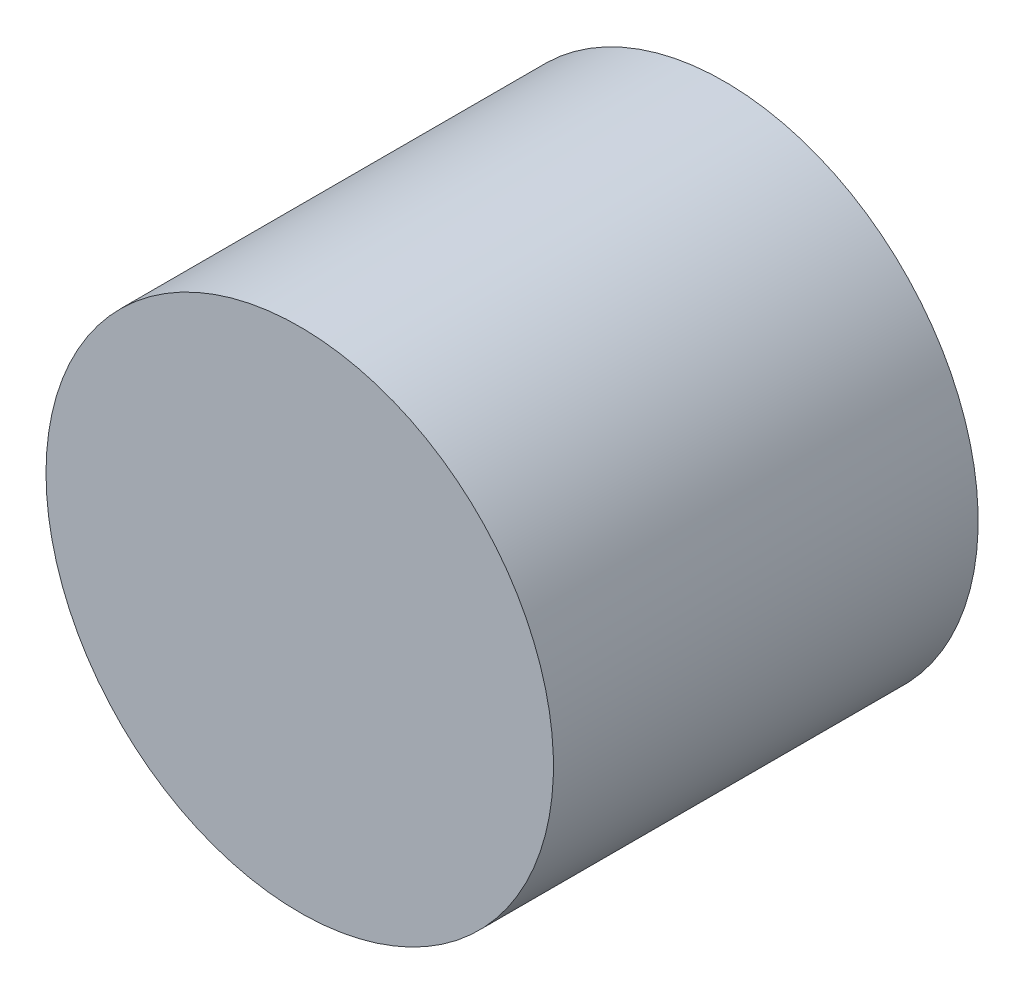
from build123d import *

# Parameters (mm, degrees)
SKETCH1_R         = 4.6
RUBBER_FEET_DEPTH = 7.7


with BuildPart() as part:
    # Sketch1 → rubber feet (new body)
    with BuildSketch(Plane.XY):
        with Locations(Location((-0.739379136, 0.684339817, 0), (0, 0, 180))):
            Circle(SKETCH1_R)
    extrude(amount=RUBBER_FEET_DEPTH)


solid = part.part
